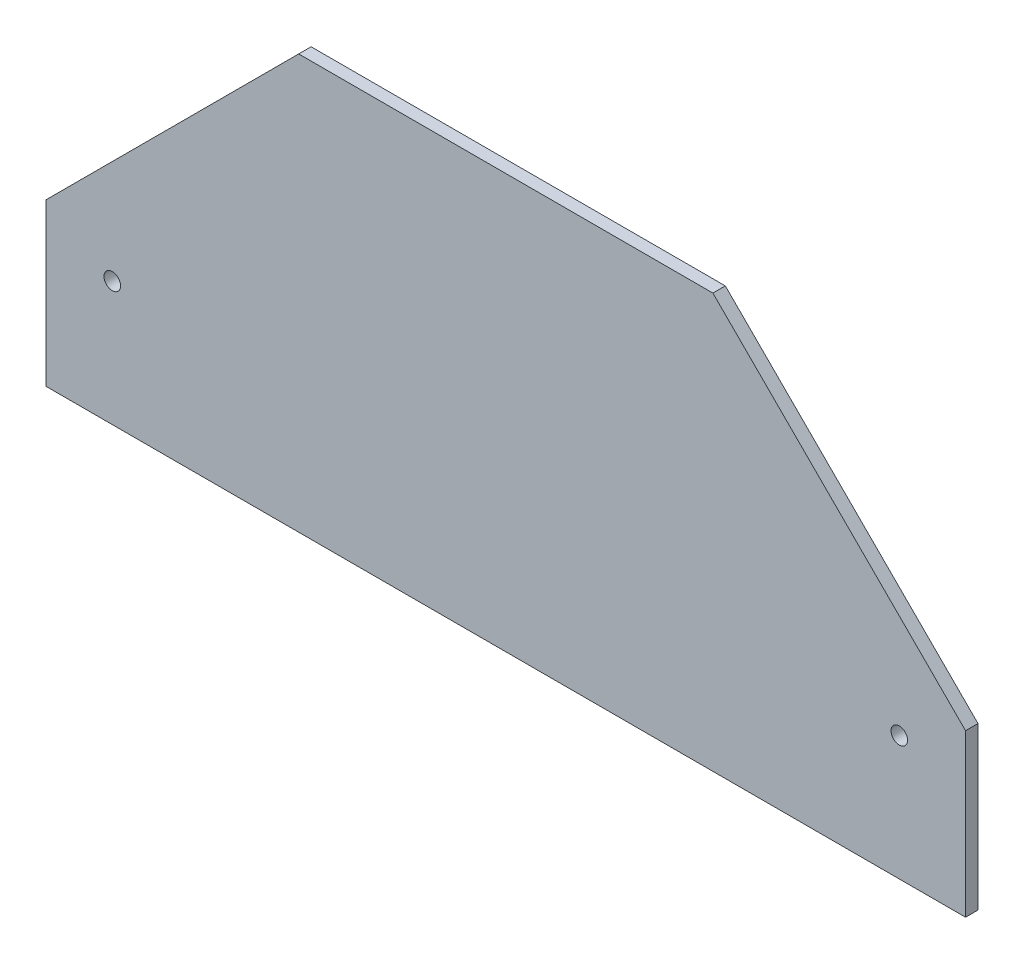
from build123d import *

# Parameters (mm, degrees)
SKETCH1_W           = 1110
SKETCH1_H           = 500
SKETCH1_R           = 10
BOSS_EXTRUDE1_DEPTH = 15
SKETCH2_OUTSIDE_W   = 1355.502
SKETCH2_OUTSIDE_H   = 745.502
CUT_EXTRUDE1_DEPTH  = 609.892437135


with BuildPart() as part:
    # Sketch1 → Boss-Extrude1 (new body)
    with BuildSketch(Plane.XY):
        Rectangle(SKETCH1_W, SKETCH1_H)
        with Locations((-475, -100)):
            Circle(SKETCH1_R, mode=Mode.SUBTRACT)
        with Locations((475, -100)):
            Circle(SKETCH1_R, mode=Mode.SUBTRACT)
    extrude(amount=BOSS_EXTRUDE1_DEPTH)

    # Sketch2 outside → Cut-Extrude1 (cut, through all)
    with BuildSketch(Plane.XY):
        Rectangle(SKETCH2_OUTSIDE_W, SKETCH2_OUTSIDE_H)
        Polygon((-555, -250), (-555, -55), (-250, 250), (250, 250), (555, -55), (555, -250), align=None, mode=Mode.SUBTRACT)
    extrude(amount=CUT_EXTRUDE1_DEPTH, mode=Mode.SUBTRACT)


solid = part.part
